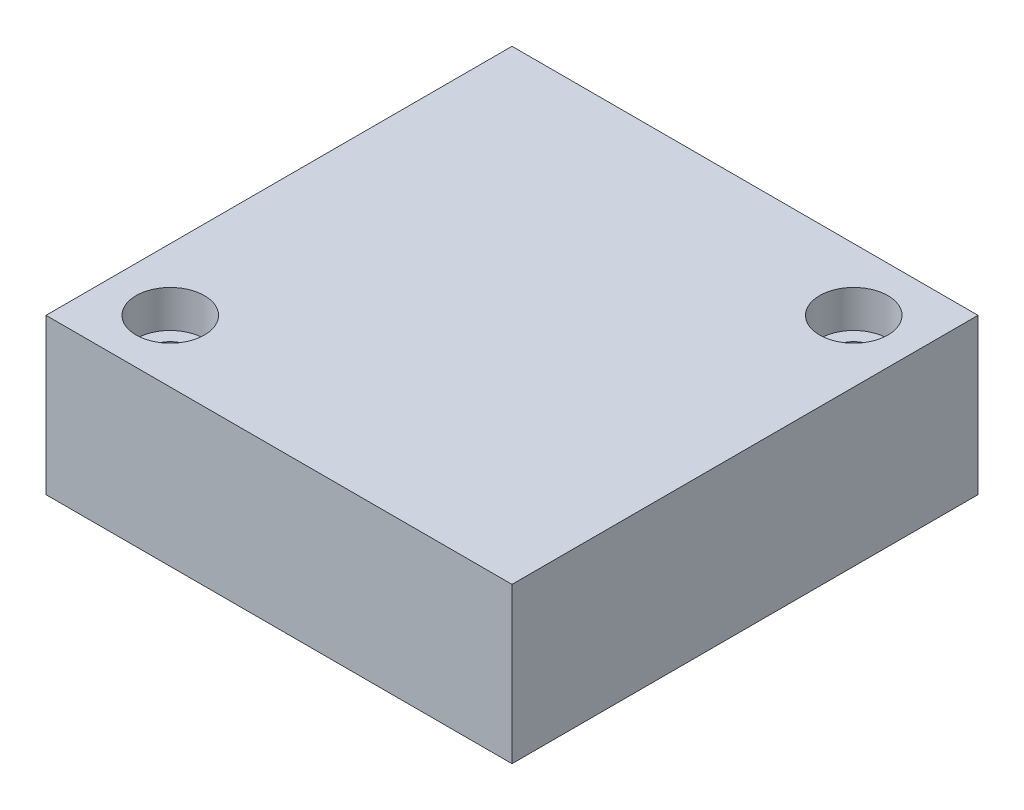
from build123d import *

# Parameters (mm, degrees)
SKETCH1_W                      = 75
SKETCH1_H                      = 75
BOSS_EXTRUDE1_DEPTH            = 25
CBORE_FOR_M6_SHCS1_D           = 6.6
CBORE_FOR_M6_SHCS1_CBORE_D     = 11
CBORE_FOR_M6_SHCS1_CBORE_DEPTH = 6


with BuildPart() as part:
    # Sketch1 → Boss-Extrude1 (new body)
    with BuildSketch(Plane(origin=(0, 0, 0), x_dir=(1, 0, 0), z_dir=(0, 1, 0))):
        Rectangle(SKETCH1_W, SKETCH1_H)
    extrude(amount=BOSS_EXTRUDE1_DEPTH)

    # CBORE for M6 SHCS1 (through all)
    with Locations(Plane(origin=(0, 25, 0), x_dir=(1, 0, 0), z_dir=(0, 1, 0))):
        with Locations((-27.5, -27.5), (27.5, 27.5)):
            CounterBoreHole(CBORE_FOR_M6_SHCS1_D / 2, CBORE_FOR_M6_SHCS1_CBORE_D / 2, CBORE_FOR_M6_SHCS1_CBORE_DEPTH)


solid = part.part
